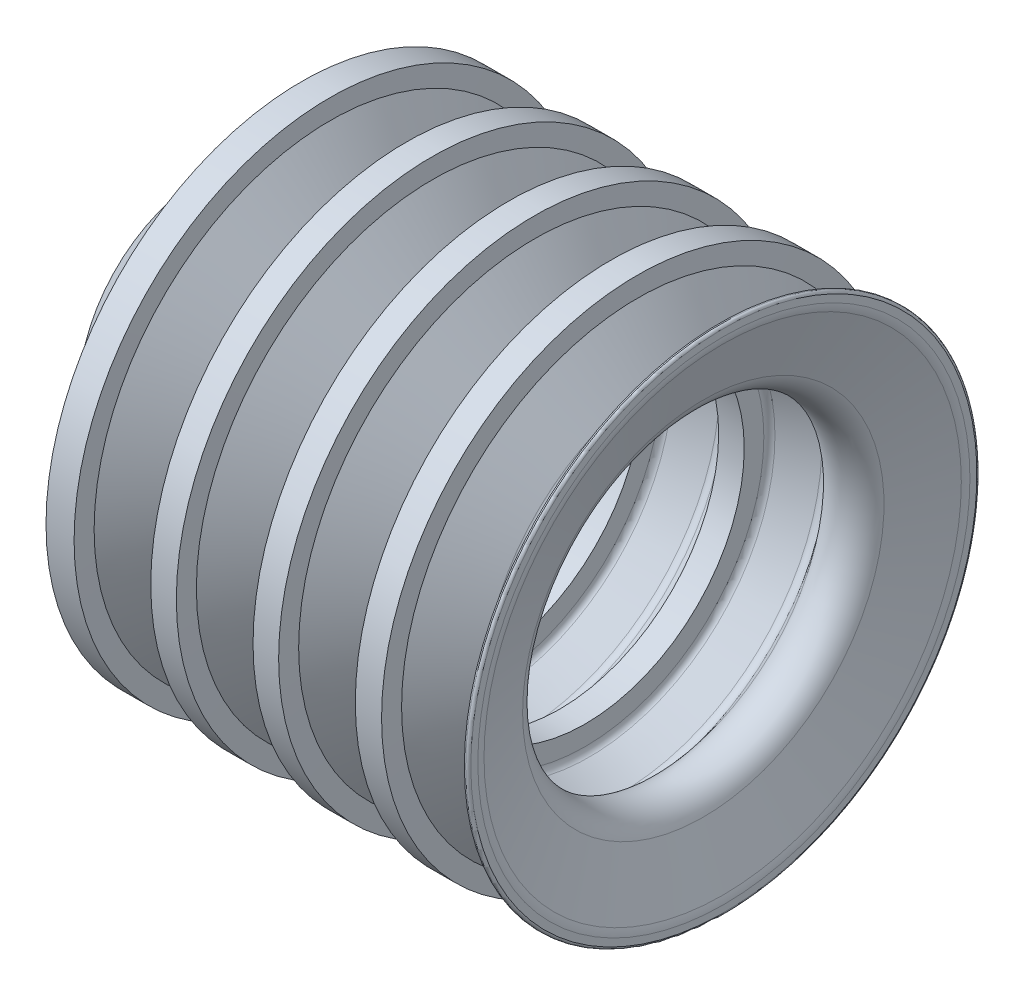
ISO-10303-21;
HEADER;
FILE_DESCRIPTION(('STEP AP214'),'2;1');
FILE_NAME('part.step','',(''),(''),'','','');
FILE_SCHEMA(('AUTOMOTIVE_DESIGN { 1 0 10303 214 1 1 1 1 }'));
ENDSEC;
DATA;
#1=APPLICATION_CONTEXT('core data for automotive mechanical design processes');
#2=APPLICATION_PROTOCOL_DEFINITION('international standard','automotive_design',2000,#1);
#3=PRODUCT_CONTEXT('',#1,'mechanical');
#4=PRODUCT('Part','Part','',(#3));
#5=PRODUCT_RELATED_PRODUCT_CATEGORY('part','',(#4));
#6=PRODUCT_DEFINITION_FORMATION('','',#4);
#7=PRODUCT_DEFINITION_CONTEXT('part definition',#1,'design');
#8=PRODUCT_DEFINITION('design','',#6,#7);
#9=PRODUCT_DEFINITION_SHAPE('','',#8);
#10=(LENGTH_UNIT() NAMED_UNIT(*) SI_UNIT(.MILLI.,.METRE.));
#11=(NAMED_UNIT(*) PLANE_ANGLE_UNIT() SI_UNIT($,.RADIAN.));
#12=(NAMED_UNIT(*) SI_UNIT($,.STERADIAN.) SOLID_ANGLE_UNIT());
#13=UNCERTAINTY_MEASURE_WITH_UNIT(LENGTH_MEASURE(1.E-05),#10,'distance_accuracy_value','');
#14=(GEOMETRIC_REPRESENTATION_CONTEXT(3) GLOBAL_UNCERTAINTY_ASSIGNED_CONTEXT((#13)) GLOBAL_UNIT_ASSIGNED_CONTEXT((#10,
#11,#12)) REPRESENTATION_CONTEXT('',''));
#15=CARTESIAN_POINT('',(0.,0.,0.));
#16=DIRECTION('',(0.,0.,1.));
#17=DIRECTION('',(1.,0.,0.));
#18=AXIS2_PLACEMENT_3D('',#15,#16,#17);
#19=CARTESIAN_POINT('',(51.11242,24.99868,0.));
#20=DIRECTION('',(-1.,0.,0.));
#21=DIRECTION('',(0.,0.,1.));
#22=AXIS2_PLACEMENT_3D('',#19,#20,#21);
#23=PLANE('',#22);
#24=CARTESIAN_POINT('',(51.11242,0.,0.));
#25=DIRECTION('',(-1.,0.,0.));
#26=DIRECTION('',(0.,0.,1.));
#27=AXIS2_PLACEMENT_3D('',#24,#25,#26);
#28=CIRCLE('',#27,24.0613960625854);
#29=CARTESIAN_POINT('',(51.11242,0.,24.0613960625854));
#30=VERTEX_POINT('',#29);
#31=EDGE_CURVE('E277',#30,#30,#28,.T.);
#32=ORIENTED_EDGE('',*,*,#31,.T.);
#33=EDGE_LOOP('',(#32));
#34=FACE_BOUND('',#33,.T.);
#35=CARTESIAN_POINT('',(51.11242,0.,0.));
#36=DIRECTION('',(-1.,0.,0.));
#37=DIRECTION('',(0.,0.,1.));
#38=AXIS2_PLACEMENT_3D('',#35,#36,#37);
#39=CIRCLE('',#38,24.74468);
#40=CARTESIAN_POINT('',(51.11242,0.,24.74468));
#41=VERTEX_POINT('',#40);
#42=EDGE_CURVE('E9',#41,#41,#39,.F.);
#43=ORIENTED_EDGE('',*,*,#42,.T.);
#44=EDGE_LOOP('',(#43));
#45=FACE_BOUND('',#44,.T.);
#46=ADVANCED_FACE('F14',(#34,#45),#23,.F.);
#47=CARTESIAN_POINT('',(0.,0.,0.));
#48=DIRECTION('',(-1.,0.,0.));
#49=DIRECTION('',(0.,0.,1.));
#50=AXIS2_PLACEMENT_3D('',#47,#48,#49);
#51=CYLINDRICAL_SURFACE('',#50,24.99868);
#52=CARTESIAN_POINT('',(50.85842,0.,0.));
#53=DIRECTION('',(-1.,0.,0.));
#54=DIRECTION('',(0.,0.,1.));
#55=AXIS2_PLACEMENT_3D('',#52,#53,#54);
#56=CIRCLE('',#55,24.99868);
#57=CARTESIAN_POINT('',(50.85842,0.,24.99868));
#58=VERTEX_POINT('',#57);
#59=EDGE_CURVE('E21',#58,#58,#56,.T.);
#60=ORIENTED_EDGE('',*,*,#59,.T.);
#61=EDGE_LOOP('',(#60));
#62=FACE_BOUND('',#61,.T.);
#63=CARTESIAN_POINT('',(50.73142,0.,0.));
#64=DIRECTION('',(-1.,0.,0.));
#65=DIRECTION('',(0.,0.,1.));
#66=AXIS2_PLACEMENT_3D('',#63,#64,#65);
#67=CIRCLE('',#66,24.99868);
#68=CARTESIAN_POINT('',(50.73142,0.,24.99868));
#69=VERTEX_POINT('',#68);
#70=EDGE_CURVE('E46',#69,#69,#67,.T.);
#71=ORIENTED_EDGE('',*,*,#70,.F.);
#72=EDGE_LOOP('',(#71));
#73=FACE_BOUND('',#72,.T.);
#74=ADVANCED_FACE('F319',(#62,#73),#51,.T.);
#75=CARTESIAN_POINT('',(50.73142,0.,0.));
#76=DIRECTION('',(1.,0.,0.));
#77=DIRECTION('',(0.,0.,-1.));
#78=AXIS2_PLACEMENT_3D('',#75,#76,#77);
#79=CONICAL_SURFACE('',#78,24.99868,1.02625360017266);
#80=CARTESIAN_POINT('',(46.75378,0.,0.));
#81=DIRECTION('',(-1.,0.,0.));
#82=DIRECTION('',(0.,0.,1.));
#83=AXIS2_PLACEMENT_3D('',#80,#81,#82);
#84=CIRCLE('',#83,18.4308157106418);
#85=CARTESIAN_POINT('',(46.75378,0.,18.4308157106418));
#86=VERTEX_POINT('',#85);
#87=EDGE_CURVE('E50',#86,#86,#84,.T.);
#88=ORIENTED_EDGE('',*,*,#87,.F.);
#89=EDGE_LOOP('',(#88));
#90=FACE_BOUND('',#89,.T.);
#91=ORIENTED_EDGE('',*,*,#70,.T.);
#92=EDGE_LOOP('',(#91));
#93=FACE_BOUND('',#92,.T.);
#94=ADVANCED_FACE('F325',(#90,#93),#79,.T.);
#95=CARTESIAN_POINT('',(46.3510684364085,0.,0.));
#96=DIRECTION('',(-1.,0.,0.));
#97=DIRECTION('',(0.,0.,1.));
#98=AXIS2_PLACEMENT_3D('',#95,#96,#97);
#99=TOROIDAL_SURFACE('',#98,18.7404726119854,0.507999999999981);
#100=CARTESIAN_POINT('',(45.902111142,0.,0.));
#101=DIRECTION('',(-1.,0.,0.));
#102=DIRECTION('',(0.,0.,1.));
#103=AXIS2_PLACEMENT_3D('',#100,#101,#102);
#104=CIRCLE('',#103,18.5027724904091);
#105=CARTESIAN_POINT('',(45.902111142,0.,18.5027724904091));
#106=VERTEX_POINT('',#105);
#107=EDGE_CURVE('E54',#106,#106,#104,.T.);
#108=ORIENTED_EDGE('',*,*,#107,.F.);
#109=EDGE_LOOP('',(#108));
#110=FACE_BOUND('',#109,.T.);
#111=ORIENTED_EDGE('',*,*,#87,.T.);
#112=EDGE_LOOP('',(#111));
#113=FACE_BOUND('',#112,.T.);
#114=ADVANCED_FACE('F480',(#110,#113),#99,.F.);
#115=CARTESIAN_POINT('',(45.902111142,0.,0.));
#116=DIRECTION('',(-1.,0.,0.));
#117=DIRECTION('',(0.,0.,1.));
#118=AXIS2_PLACEMENT_3D('',#115,#116,#117);
#119=CONICAL_SURFACE('',#118,18.5027724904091,0.963421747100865);
#120=CARTESIAN_POINT('',(42.7025205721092,0.,0.));
#121=DIRECTION('',(-1.,0.,0.));
#122=DIRECTION('',(0.,0.,1.));
#123=AXIS2_PLACEMENT_3D('',#120,#121,#122);
#124=CIRCLE('',#123,23.10638);
#125=CARTESIAN_POINT('',(42.7025205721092,0.,23.10638));
#126=VERTEX_POINT('',#125);
#127=EDGE_CURVE('E58',#126,#126,#124,.T.);
#128=ORIENTED_EDGE('',*,*,#127,.F.);
#129=EDGE_LOOP('',(#128));
#130=FACE_BOUND('',#129,.T.);
#131=ORIENTED_EDGE('',*,*,#107,.T.);
#132=EDGE_LOOP('',(#131));
#133=FACE_BOUND('',#132,.T.);
#134=ADVANCED_FACE('F474',(#130,#133),#119,.T.);
#135=CARTESIAN_POINT('',(42.7025205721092,0.,0.));
#136=DIRECTION('',(-1.,0.,0.));
#137=DIRECTION('',(0.,0.,1.));
#138=AXIS2_PLACEMENT_3D('',#135,#136,#137);
#139=CONICAL_SURFACE('',#138,23.10638,1.53588974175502);
#140=CARTESIAN_POINT('',(42.63644,0.,0.));
#141=DIRECTION('',(-1.,0.,0.));
#142=DIRECTION('',(0.,0.,1.));
#143=AXIS2_PLACEMENT_3D('',#140,#141,#142);
#144=CIRCLE('',#143,24.99868);
#145=CARTESIAN_POINT('',(42.63644,0.,24.99868));
#146=VERTEX_POINT('',#145);
#147=EDGE_CURVE('E62',#146,#146,#144,.T.);
#148=ORIENTED_EDGE('',*,*,#147,.F.);
#149=EDGE_LOOP('',(#148));
#150=FACE_BOUND('',#149,.T.);
#151=ORIENTED_EDGE('',*,*,#127,.T.);
#152=EDGE_LOOP('',(#151));
#153=FACE_BOUND('',#152,.T.);
#154=ADVANCED_FACE('F468',(#150,#153),#139,.T.);
#155=CARTESIAN_POINT('',(0.,0.,0.));
#156=DIRECTION('',(-1.,0.,0.));
#157=DIRECTION('',(0.,0.,1.));
#158=AXIS2_PLACEMENT_3D('',#155,#156,#157);
#159=CYLINDRICAL_SURFACE('',#158,24.99868);
#160=CARTESIAN_POINT('',(40.0685,0.,0.));
#161=DIRECTION('',(-1.,0.,0.));
#162=DIRECTION('',(0.,0.,1.));
#163=AXIS2_PLACEMENT_3D('',#160,#161,#162);
#164=CIRCLE('',#163,24.99868);
#165=CARTESIAN_POINT('',(40.0685,0.,24.99868));
#166=VERTEX_POINT('',#165);
#167=EDGE_CURVE('E66',#166,#166,#164,.T.);
#168=ORIENTED_EDGE('',*,*,#167,.F.);
#169=EDGE_LOOP('',(#168));
#170=FACE_BOUND('',#169,.T.);
#171=ORIENTED_EDGE('',*,*,#147,.T.);
#172=EDGE_LOOP('',(#171));
#173=FACE_BOUND('',#172,.T.);
#174=ADVANCED_FACE('F462',(#170,#173),#159,.T.);
#175=CARTESIAN_POINT('',(40.0685,0.,0.));
#176=DIRECTION('',(1.,0.,0.));
#177=DIRECTION('',(0.,0.,-1.));
#178=AXIS2_PLACEMENT_3D('',#175,#176,#177);
#179=CONICAL_SURFACE('',#178,24.99868,1.53588974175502);
#180=CARTESIAN_POINT('',(40.0024194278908,0.,0.));
#181=DIRECTION('',(-1.,0.,0.));
#182=DIRECTION('',(0.,0.,1.));
#183=AXIS2_PLACEMENT_3D('',#180,#181,#182);
#184=CIRCLE('',#183,23.10638);
#185=CARTESIAN_POINT('',(40.0024194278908,0.,23.10638));
#186=VERTEX_POINT('',#185);
#187=EDGE_CURVE('E70',#186,#186,#184,.T.);
#188=ORIENTED_EDGE('',*,*,#187,.F.);
#189=EDGE_LOOP('',(#188));
#190=FACE_BOUND('',#189,.T.);
#191=ORIENTED_EDGE('',*,*,#167,.T.);
#192=EDGE_LOOP('',(#191));
#193=FACE_BOUND('',#192,.T.);
#194=ADVANCED_FACE('F456',(#190,#193),#179,.T.);
#195=CARTESIAN_POINT('',(40.0024194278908,0.,0.));
#196=DIRECTION('',(1.,0.,0.));
#197=DIRECTION('',(0.,0.,-1.));
#198=AXIS2_PLACEMENT_3D('',#195,#196,#197);
#199=CONICAL_SURFACE('',#198,23.10638,0.963421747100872);
#200=CARTESIAN_POINT('',(36.73660379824,0.,0.));
#201=DIRECTION('',(-1.,0.,0.));
#202=DIRECTION('',(0.,0.,1.));
#203=AXIS2_PLACEMENT_3D('',#200,#201,#202);
#204=CIRCLE('',#203,18.4074871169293);
#205=CARTESIAN_POINT('',(36.73660379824,0.,18.4074871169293));
#206=VERTEX_POINT('',#205);
#207=EDGE_CURVE('E74',#206,#206,#204,.T.);
#208=ORIENTED_EDGE('',*,*,#207,.F.);
#209=EDGE_LOOP('',(#208));
#210=FACE_BOUND('',#209,.T.);
#211=ORIENTED_EDGE('',*,*,#187,.T.);
#212=EDGE_LOOP('',(#211));
#213=FACE_BOUND('',#212,.T.);
#214=ADVANCED_FACE('F450',(#210,#213),#199,.T.);
#215=CARTESIAN_POINT('',(36.31946,0.,0.));
#216=DIRECTION('',(-1.,0.,0.));
#217=DIRECTION('',(0.,0.,1.));
#218=AXIS2_PLACEMENT_3D('',#215,#216,#217);
#219=TOROIDAL_SURFACE('',#218,18.697409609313,0.508000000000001);
#220=CARTESIAN_POINT('',(35.9023162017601,0.,0.));
#221=DIRECTION('',(-1.,0.,0.));
#222=DIRECTION('',(0.,0.,1.));
#223=AXIS2_PLACEMENT_3D('',#220,#221,#222);
#224=CIRCLE('',#223,18.4074871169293);
#225=CARTESIAN_POINT('',(35.9023162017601,0.,18.4074871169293));
#226=VERTEX_POINT('',#225);
#227=EDGE_CURVE('E78',#226,#226,#224,.T.);
#228=ORIENTED_EDGE('',*,*,#227,.F.);
#229=EDGE_LOOP('',(#228));
#230=FACE_BOUND('',#229,.T.);
#231=ORIENTED_EDGE('',*,*,#207,.T.);
#232=EDGE_LOOP('',(#231));
#233=FACE_BOUND('',#232,.T.);
#234=ADVANCED_FACE('F444',(#230,#233),#219,.F.);
#235=CARTESIAN_POINT('',(35.9023162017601,0.,0.));
#236=DIRECTION('',(-1.,0.,0.));
#237=DIRECTION('',(0.,0.,1.));
#238=AXIS2_PLACEMENT_3D('',#235,#236,#237);
#239=CONICAL_SURFACE('',#238,18.4074871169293,0.963421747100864);
#240=CARTESIAN_POINT('',(32.6365005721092,0.,0.));
#241=DIRECTION('',(-1.,0.,0.));
#242=DIRECTION('',(0.,0.,1.));
#243=AXIS2_PLACEMENT_3D('',#240,#241,#242);
#244=CIRCLE('',#243,23.10638);
#245=CARTESIAN_POINT('',(32.6365005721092,0.,23.10638));
#246=VERTEX_POINT('',#245);
#247=EDGE_CURVE('E82',#246,#246,#244,.T.);
#248=ORIENTED_EDGE('',*,*,#247,.F.);
#249=EDGE_LOOP('',(#248));
#250=FACE_BOUND('',#249,.T.);
#251=ORIENTED_EDGE('',*,*,#227,.T.);
#252=EDGE_LOOP('',(#251));
#253=FACE_BOUND('',#252,.T.);
#254=ADVANCED_FACE('F438',(#250,#253),#239,.T.);
#255=CARTESIAN_POINT('',(32.6365005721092,0.,0.));
#256=DIRECTION('',(-1.,0.,0.));
#257=DIRECTION('',(0.,0.,1.));
#258=AXIS2_PLACEMENT_3D('',#255,#256,#257);
#259=CONICAL_SURFACE('',#258,23.10638,1.53588974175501);
#260=CARTESIAN_POINT('',(32.57042,0.,0.));
#261=DIRECTION('',(-1.,0.,0.));
#262=DIRECTION('',(0.,0.,1.));
#263=AXIS2_PLACEMENT_3D('',#260,#261,#262);
#264=CIRCLE('',#263,24.99868);
#265=CARTESIAN_POINT('',(32.57042,0.,24.99868));
#266=VERTEX_POINT('',#265);
#267=EDGE_CURVE('E86',#266,#266,#264,.T.);
#268=ORIENTED_EDGE('',*,*,#267,.F.);
#269=EDGE_LOOP('',(#268));
#270=FACE_BOUND('',#269,.T.);
#271=ORIENTED_EDGE('',*,*,#247,.T.);
#272=EDGE_LOOP('',(#271));
#273=FACE_BOUND('',#272,.T.);
#274=ADVANCED_FACE('F432',(#270,#273),#259,.T.);
#275=CARTESIAN_POINT('',(0.,0.,0.));
#276=DIRECTION('',(-1.,0.,0.));
#277=DIRECTION('',(0.,0.,1.));
#278=AXIS2_PLACEMENT_3D('',#275,#276,#277);
#279=CYLINDRICAL_SURFACE('',#278,24.99868);
#280=CARTESIAN_POINT('',(30.06852,0.,0.));
#281=DIRECTION('',(-1.,0.,0.));
#282=DIRECTION('',(0.,0.,1.));
#283=AXIS2_PLACEMENT_3D('',#280,#281,#282);
#284=CIRCLE('',#283,24.99868);
#285=CARTESIAN_POINT('',(30.06852,0.,24.99868));
#286=VERTEX_POINT('',#285);
#287=EDGE_CURVE('E90',#286,#286,#284,.T.);
#288=ORIENTED_EDGE('',*,*,#287,.F.);
#289=EDGE_LOOP('',(#288));
#290=FACE_BOUND('',#289,.T.);
#291=ORIENTED_EDGE('',*,*,#267,.T.);
#292=EDGE_LOOP('',(#291));
#293=FACE_BOUND('',#292,.T.);
#294=ADVANCED_FACE('F426',(#290,#293),#279,.T.);
#295=CARTESIAN_POINT('',(30.06852,0.,0.));
#296=DIRECTION('',(1.,0.,0.));
#297=DIRECTION('',(0.,0.,-1.));
#298=AXIS2_PLACEMENT_3D('',#295,#296,#297);
#299=CONICAL_SURFACE('',#298,24.99868,1.53588974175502);
#300=CARTESIAN_POINT('',(30.0024394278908,0.,0.));
#301=DIRECTION('',(-1.,0.,0.));
#302=DIRECTION('',(0.,0.,1.));
#303=AXIS2_PLACEMENT_3D('',#300,#301,#302);
#304=CIRCLE('',#303,23.10638);
#305=CARTESIAN_POINT('',(30.0024394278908,0.,23.10638));
#306=VERTEX_POINT('',#305);
#307=EDGE_CURVE('E94',#306,#306,#304,.T.);
#308=ORIENTED_EDGE('',*,*,#307,.F.);
#309=EDGE_LOOP('',(#308));
#310=FACE_BOUND('',#309,.T.);
#311=ORIENTED_EDGE('',*,*,#287,.T.);
#312=EDGE_LOOP('',(#311));
#313=FACE_BOUND('',#312,.T.);
#314=ADVANCED_FACE('F420',(#310,#313),#299,.T.);
#315=CARTESIAN_POINT('',(30.0024394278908,0.,0.));
#316=DIRECTION('',(1.,0.,0.));
#317=DIRECTION('',(0.,0.,-1.));
#318=AXIS2_PLACEMENT_3D('',#315,#316,#317);
#319=CONICAL_SURFACE('',#318,23.10638,0.963421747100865);
#320=CARTESIAN_POINT('',(26.73604,0.,0.));
#321=DIRECTION('',(-1.,0.,0.));
#322=DIRECTION('',(0.,0.,1.));
#323=AXIS2_PLACEMENT_3D('',#320,#321,#322);
#324=CIRCLE('',#323,18.4066471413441);
#325=CARTESIAN_POINT('',(26.73604,0.,18.4066471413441));
#326=VERTEX_POINT('',#325);
#327=EDGE_CURVE('E98',#326,#326,#324,.T.);
#328=ORIENTED_EDGE('',*,*,#327,.F.);
#329=EDGE_LOOP('',(#328));
#330=FACE_BOUND('',#329,.T.);
#331=ORIENTED_EDGE('',*,*,#307,.T.);
#332=EDGE_LOOP('',(#331));
#333=FACE_BOUND('',#332,.T.);
#334=ADVANCED_FACE('F414',(#330,#333),#319,.T.);
#335=CARTESIAN_POINT('',(26.3188962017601,0.,0.));
#336=DIRECTION('',(-1.,0.,0.));
#337=DIRECTION('',(0.,0.,1.));
#338=AXIS2_PLACEMENT_3D('',#335,#336,#337);
#339=TOROIDAL_SURFACE('',#338,18.6965696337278,0.508000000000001);
#340=CARTESIAN_POINT('',(25.90292,0.,0.));
#341=DIRECTION('',(-1.,0.,0.));
#342=DIRECTION('',(0.,0.,1.));
#343=AXIS2_PLACEMENT_3D('',#340,#341,#342);
#344=CIRCLE('',#343,18.4049743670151);
#345=CARTESIAN_POINT('',(25.90292,0.,18.4049743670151));
#346=VERTEX_POINT('',#345);
#347=EDGE_CURVE('E102',#346,#346,#344,.T.);
#348=ORIENTED_EDGE('',*,*,#347,.F.);
#349=EDGE_LOOP('',(#348));
#350=FACE_BOUND('',#349,.T.);
#351=ORIENTED_EDGE('',*,*,#327,.T.);
#352=EDGE_LOOP('',(#351));
#353=FACE_BOUND('',#352,.T.);
#354=ADVANCED_FACE('F408',(#350,#353),#339,.F.);
#355=CARTESIAN_POINT('',(25.90292,0.,0.));
#356=DIRECTION('',(-1.,0.,0.));
#357=DIRECTION('',(0.,0.,1.));
#358=AXIS2_PLACEMENT_3D('',#355,#356,#357);
#359=CONICAL_SURFACE('',#358,18.4049743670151,0.963421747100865);
#360=CARTESIAN_POINT('',(22.6353579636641,0.,0.));
#361=DIRECTION('',(-1.,0.,0.));
#362=DIRECTION('',(0.,0.,1.));
#363=AXIS2_PLACEMENT_3D('',#360,#361,#362);
#364=CIRCLE('',#363,23.10638);
#365=CARTESIAN_POINT('',(22.6353579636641,0.,23.10638));
#366=VERTEX_POINT('',#365);
#367=EDGE_CURVE('E106',#366,#366,#364,.T.);
#368=ORIENTED_EDGE('',*,*,#367,.F.);
#369=EDGE_LOOP('',(#368));
#370=FACE_BOUND('',#369,.T.);
#371=ORIENTED_EDGE('',*,*,#347,.T.);
#372=EDGE_LOOP('',(#371));
#373=FACE_BOUND('',#372,.T.);
#374=ADVANCED_FACE('F402',(#370,#373),#359,.T.);
#375=CARTESIAN_POINT('',(22.6353579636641,0.,0.));
#376=DIRECTION('',(-1.,0.,0.));
#377=DIRECTION('',(0.,0.,1.));
#378=AXIS2_PLACEMENT_3D('',#375,#376,#377);
#379=CONICAL_SURFACE('',#378,23.10638,1.53588974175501);
#380=CARTESIAN_POINT('',(22.5692773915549,0.,0.));
#381=DIRECTION('',(-1.,0.,0.));
#382=DIRECTION('',(0.,0.,1.));
#383=AXIS2_PLACEMENT_3D('',#380,#381,#382);
#384=CIRCLE('',#383,24.99868);
#385=CARTESIAN_POINT('',(22.5692773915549,0.,24.99868));
#386=VERTEX_POINT('',#385);
#387=EDGE_CURVE('E110',#386,#386,#384,.T.);
#388=ORIENTED_EDGE('',*,*,#387,.F.);
#389=EDGE_LOOP('',(#388));
#390=FACE_BOUND('',#389,.T.);
#391=ORIENTED_EDGE('',*,*,#367,.T.);
#392=EDGE_LOOP('',(#391));
#393=FACE_BOUND('',#392,.T.);
#394=ADVANCED_FACE('F396',(#390,#393),#379,.T.);
#395=CARTESIAN_POINT('',(0.,0.,0.));
#396=DIRECTION('',(-1.,0.,0.));
#397=DIRECTION('',(0.,0.,1.));
#398=AXIS2_PLACEMENT_3D('',#395,#396,#397);
#399=CYLINDRICAL_SURFACE('',#398,24.99868);
#400=CARTESIAN_POINT('',(20.06854,0.,0.));
#401=DIRECTION('',(-1.,0.,0.));
#402=DIRECTION('',(0.,0.,1.));
#403=AXIS2_PLACEMENT_3D('',#400,#401,#402);
#404=CIRCLE('',#403,24.99868);
#405=CARTESIAN_POINT('',(20.06854,0.,24.99868));
#406=VERTEX_POINT('',#405);
#407=EDGE_CURVE('E114',#406,#406,#404,.T.);
#408=ORIENTED_EDGE('',*,*,#407,.F.);
#409=EDGE_LOOP('',(#408));
#410=FACE_BOUND('',#409,.T.);
#411=ORIENTED_EDGE('',*,*,#387,.T.);
#412=EDGE_LOOP('',(#411));
#413=FACE_BOUND('',#412,.T.);
#414=ADVANCED_FACE('F390',(#410,#413),#399,.T.);
#415=CARTESIAN_POINT('',(20.06854,0.,0.));
#416=DIRECTION('',(1.,0.,0.));
#417=DIRECTION('',(0.,0.,-1.));
#418=AXIS2_PLACEMENT_3D('',#415,#416,#417);
#419=CONICAL_SURFACE('',#418,24.99868,1.53588974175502);
#420=CARTESIAN_POINT('',(20.0024594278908,0.,0.));
#421=DIRECTION('',(-1.,0.,0.));
#422=DIRECTION('',(0.,0.,1.));
#423=AXIS2_PLACEMENT_3D('',#420,#421,#422);
#424=CIRCLE('',#423,23.10638);
#425=CARTESIAN_POINT('',(20.0024594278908,0.,23.10638));
#426=VERTEX_POINT('',#425);
#427=EDGE_CURVE('E118',#426,#426,#424,.T.);
#428=ORIENTED_EDGE('',*,*,#427,.F.);
#429=EDGE_LOOP('',(#428));
#430=FACE_BOUND('',#429,.T.);
#431=ORIENTED_EDGE('',*,*,#407,.T.);
#432=EDGE_LOOP('',(#431));
#433=FACE_BOUND('',#432,.T.);
#434=ADVANCED_FACE('F384',(#430,#433),#419,.T.);
#435=CARTESIAN_POINT('',(20.0024594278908,0.,0.));
#436=DIRECTION('',(1.,0.,0.));
#437=DIRECTION('',(0.,0.,-1.));
#438=AXIS2_PLACEMENT_3D('',#435,#436,#437);
#439=CONICAL_SURFACE('',#438,23.10638,0.963421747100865);
#440=CARTESIAN_POINT('',(16.73606,0.,0.));
#441=DIRECTION('',(-1.,0.,0.));
#442=DIRECTION('',(0.,0.,1.));
#443=AXIS2_PLACEMENT_3D('',#440,#441,#442);
#444=CIRCLE('',#443,18.4066471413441);
#445=CARTESIAN_POINT('',(16.73606,0.,18.4066471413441));
#446=VERTEX_POINT('',#445);
#447=EDGE_CURVE('E122',#446,#446,#444,.T.);
#448=ORIENTED_EDGE('',*,*,#447,.F.);
#449=EDGE_LOOP('',(#448));
#450=FACE_BOUND('',#449,.T.);
#451=ORIENTED_EDGE('',*,*,#427,.T.);
#452=EDGE_LOOP('',(#451));
#453=FACE_BOUND('',#452,.T.);
#454=ADVANCED_FACE('F378',(#450,#453),#439,.T.);
#455=CARTESIAN_POINT('',(16.3195,0.,0.));
#456=DIRECTION('',(-1.,0.,0.));
#457=DIRECTION('',(0.,0.,1.));
#458=AXIS2_PLACEMENT_3D('',#455,#456,#457);
#459=TOROIDAL_SURFACE('',#458,18.6974078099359,0.507999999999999);
#460=CARTESIAN_POINT('',(15.90294,0.,0.));
#461=DIRECTION('',(-1.,0.,0.));
#462=DIRECTION('',(0.,0.,1.));
#463=AXIS2_PLACEMENT_3D('',#460,#461,#462);
#464=CIRCLE('',#463,18.406647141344);
#465=CARTESIAN_POINT('',(15.90294,0.,18.406647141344));
#466=VERTEX_POINT('',#465);
#467=EDGE_CURVE('E126',#466,#466,#464,.T.);
#468=ORIENTED_EDGE('',*,*,#467,.F.);
#469=EDGE_LOOP('',(#468));
#470=FACE_BOUND('',#469,.T.);
#471=ORIENTED_EDGE('',*,*,#447,.T.);
#472=EDGE_LOOP('',(#471));
#473=FACE_BOUND('',#472,.T.);
#474=ADVANCED_FACE('F372',(#470,#473),#459,.F.);
#475=CARTESIAN_POINT('',(15.90294,0.,0.));
#476=DIRECTION('',(-1.,0.,0.));
#477=DIRECTION('',(0.,0.,1.));
#478=AXIS2_PLACEMENT_3D('',#475,#476,#477);
#479=CONICAL_SURFACE('',#478,18.406647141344,0.963421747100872);
#480=CARTESIAN_POINT('',(12.6365405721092,0.,0.));
#481=DIRECTION('',(-1.,0.,0.));
#482=DIRECTION('',(0.,0.,1.));
#483=AXIS2_PLACEMENT_3D('',#480,#481,#482);
#484=CIRCLE('',#483,23.10638);
#485=CARTESIAN_POINT('',(12.6365405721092,0.,23.10638));
#486=VERTEX_POINT('',#485);
#487=EDGE_CURVE('E130',#486,#486,#484,.T.);
#488=ORIENTED_EDGE('',*,*,#487,.F.);
#489=EDGE_LOOP('',(#488));
#490=FACE_BOUND('',#489,.T.);
#491=ORIENTED_EDGE('',*,*,#467,.T.);
#492=EDGE_LOOP('',(#491));
#493=FACE_BOUND('',#492,.T.);
#494=ADVANCED_FACE('F366',(#490,#493),#479,.T.);
#495=CARTESIAN_POINT('',(12.6365405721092,0.,0.));
#496=DIRECTION('',(-1.,0.,0.));
#497=DIRECTION('',(0.,0.,1.));
#498=AXIS2_PLACEMENT_3D('',#495,#496,#497);
#499=CONICAL_SURFACE('',#498,23.10638,1.53588974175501);
#500=CARTESIAN_POINT('',(12.57046,0.,0.));
#501=DIRECTION('',(-1.,0.,0.));
#502=DIRECTION('',(0.,0.,1.));
#503=AXIS2_PLACEMENT_3D('',#500,#501,#502);
#504=CIRCLE('',#503,24.99868);
#505=CARTESIAN_POINT('',(12.57046,0.,24.99868));
#506=VERTEX_POINT('',#505);
#507=EDGE_CURVE('E133',#506,#506,#504,.T.);
#508=ORIENTED_EDGE('',*,*,#507,.F.);
#509=EDGE_LOOP('',(#508));
#510=FACE_BOUND('',#509,.T.);
#511=ORIENTED_EDGE('',*,*,#487,.T.);
#512=EDGE_LOOP('',(#511));
#513=FACE_BOUND('',#512,.T.);
#514=ADVANCED_FACE('F360',(#510,#513),#499,.T.);
#515=CARTESIAN_POINT('',(0.,0.,0.));
#516=DIRECTION('',(-1.,0.,0.));
#517=DIRECTION('',(0.,0.,1.));
#518=AXIS2_PLACEMENT_3D('',#515,#516,#517);
#519=CYLINDRICAL_SURFACE('',#518,24.99868);
#520=CARTESIAN_POINT('',(9.82445855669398,0.,0.));
#521=DIRECTION('',(-1.,0.,0.));
#522=DIRECTION('',(0.,0.,1.));
#523=AXIS2_PLACEMENT_3D('',#520,#521,#522);
#524=CIRCLE('',#523,24.99868);
#525=CARTESIAN_POINT('',(9.82445855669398,0.,24.99868));
#526=VERTEX_POINT('',#525);
#527=EDGE_CURVE('E137',#526,#526,#524,.T.);
#528=ORIENTED_EDGE('',*,*,#527,.F.);
#529=EDGE_LOOP('',(#528));
#530=FACE_BOUND('',#529,.T.);
#531=ORIENTED_EDGE('',*,*,#507,.T.);
#532=EDGE_LOOP('',(#531));
#533=FACE_BOUND('',#532,.T.);
#534=ADVANCED_FACE('F315',(#530,#533),#519,.T.);
#535=CARTESIAN_POINT('',(9.82445855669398,0.,0.));
#536=DIRECTION('',(1.,0.,0.));
#537=DIRECTION('',(0.,0.,-1.));
#538=AXIS2_PLACEMENT_3D('',#535,#536,#537);
#539=CONICAL_SURFACE('',#538,24.99868,1.53588974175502);
#540=CARTESIAN_POINT('',(9.79485985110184,0.,0.));
#541=DIRECTION('',(1.,0.,0.));
#542=DIRECTION('',(0.,0.,-1.));
#543=AXIS2_PLACEMENT_3D('',#540,#541,#542);
#544=CIRCLE('',#543,24.1510839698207);
#545=CARTESIAN_POINT('',(9.79485985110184,0.,-24.1510839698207));
#546=VERTEX_POINT('',#545);
#547=EDGE_CURVE('E31',#546,#546,#544,.T.);
#548=ORIENTED_EDGE('',*,*,#547,.T.);
#549=EDGE_LOOP('',(#548));
#550=FACE_BOUND('',#549,.T.);
#551=ORIENTED_EDGE('',*,*,#527,.T.);
#552=EDGE_LOOP('',(#551));
#553=FACE_BOUND('',#552,.T.);
#554=ADVANCED_FACE('F307',(#550,#553),#539,.T.);
#555=CARTESIAN_POINT('',(9.77664992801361,0.,0.));
#556=DIRECTION('',(1.,0.,0.));
#557=DIRECTION('',(0.,0.,-1.));
#558=AXIS2_PLACEMENT_3D('',#555,#556,#557);
#559=CONICAL_SURFACE('',#558,23.62962,0.876155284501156);
#560=CARTESIAN_POINT('',(9.4426523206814,0.,0.));
#561=DIRECTION('',(1.,0.,0.));
#562=DIRECTION('',(0.,0.,-1.));
#563=AXIS2_PLACEMENT_3D('',#560,#561,#562);
#564=CIRCLE('',#563,23.2287436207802);
#565=CARTESIAN_POINT('',(9.4426523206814,0.,-23.2287436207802));
#566=VERTEX_POINT('',#565);
#567=EDGE_CURVE('E40',#566,#566,#564,.F.);
#568=ORIENTED_EDGE('',*,*,#567,.T.);
#569=EDGE_LOOP('',(#568));
#570=FACE_BOUND('',#569,.T.);
#571=CARTESIAN_POINT('',(0.353135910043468,0.,0.));
#572=DIRECTION('',(-1.,0.,0.));
#573=DIRECTION('',(0.,0.,1.));
#574=AXIS2_PLACEMENT_3D('',#571,#572,#573);
#575=CIRCLE('',#574,12.3191671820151);
#576=CARTESIAN_POINT('',(0.353135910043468,0.,12.3191671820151));
#577=VERTEX_POINT('',#576);
#578=EDGE_CURVE('E141',#577,#577,#575,.T.);
#579=ORIENTED_EDGE('',*,*,#578,.F.);
#580=EDGE_LOOP('',(#579));
#581=FACE_BOUND('',#580,.T.);
#582=ADVANCED_FACE('F302',(#570,#581),#559,.T.);
#583=CARTESIAN_POINT('',(1.524,0.,0.));
#584=DIRECTION('',(-1.,0.,0.));
#585=DIRECTION('',(0.,0.,1.));
#586=AXIS2_PLACEMENT_3D('',#583,#584,#585);
#587=TOROIDAL_SURFACE('',#586,11.34364,1.524);
#588=CARTESIAN_POINT('',(0.,0.,0.));
#589=DIRECTION('',(-1.,0.,0.));
#590=DIRECTION('',(0.,0.,1.));
#591=AXIS2_PLACEMENT_3D('',#588,#589,#590);
#592=CIRCLE('',#591,11.34364);
#593=CARTESIAN_POINT('',(0.,0.,11.34364));
#594=VERTEX_POINT('',#593);
#595=EDGE_CURVE('E145',#594,#594,#592,.T.);
#596=ORIENTED_EDGE('',*,*,#595,.F.);
#597=EDGE_LOOP('',(#596));
#598=FACE_BOUND('',#597,.T.);
#599=ORIENTED_EDGE('',*,*,#578,.T.);
#600=EDGE_LOOP('',(#599));
#601=FACE_BOUND('',#600,.T.);
#602=ADVANCED_FACE('F296',(#598,#601),#587,.T.);
#603=CARTESIAN_POINT('',(0.,0.,0.));
#604=DIRECTION('',(1.,0.,0.));
#605=DIRECTION('',(0.,0.,-1.));
#606=AXIS2_PLACEMENT_3D('',#603,#604,#605);
#607=PLANE('',#606);
#608=CARTESIAN_POINT('',(0.,0.,0.));
#609=DIRECTION('',(-1.,0.,0.));
#610=DIRECTION('',(0.,0.,1.));
#611=AXIS2_PLACEMENT_3D('',#608,#609,#610);
#612=CIRCLE('',#611,6.096);
#613=CARTESIAN_POINT('',(0.,0.,6.096));
#614=VERTEX_POINT('',#613);
#615=EDGE_CURVE('E281',#614,#614,#612,.T.);
#616=ORIENTED_EDGE('',*,*,#615,.F.);
#617=EDGE_LOOP('',(#616));
#618=FACE_BOUND('',#617,.T.);
#619=ORIENTED_EDGE('',*,*,#595,.T.);
#620=EDGE_LOOP('',(#619));
#621=FACE_BOUND('',#620,.T.);
#622=ADVANCED_FACE('F292',(#618,#621),#607,.F.);
#623=CARTESIAN_POINT('',(8.27178823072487,0.,0.));
#624=DIRECTION('',(-1.,0.,0.));
#625=DIRECTION('',(0.,0.,1.));
#626=AXIS2_PLACEMENT_3D('',#623,#624,#625);
#627=TOROIDAL_SURFACE('',#626,24.2042708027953,1.524);
#628=ORIENTED_EDGE('',*,*,#547,.F.);
#629=EDGE_LOOP('',(#628));
#630=FACE_BOUND('',#629,.T.);
#631=ORIENTED_EDGE('',*,*,#567,.F.);
#632=EDGE_LOOP('',(#631));
#633=FACE_BOUND('',#632,.T.);
#634=ADVANCED_FACE('F295',(#630,#633),#627,.F.);
#635=CARTESIAN_POINT('',(50.85842,0.,0.));
#636=DIRECTION('',(-1.,0.,0.));
#637=DIRECTION('',(0.,0.,1.));
#638=AXIS2_PLACEMENT_3D('',#635,#636,#637);
#639=TOROIDAL_SURFACE('',#638,24.74468,0.254);
#640=ORIENTED_EDGE('',*,*,#42,.F.);
#641=EDGE_LOOP('',(#640));
#642=FACE_BOUND('',#641,.T.);
#643=ORIENTED_EDGE('',*,*,#59,.F.);
#644=EDGE_LOOP('',(#643));
#645=FACE_BOUND('',#644,.T.);
#646=ADVANCED_FACE('F331',(#642,#645),#639,.T.);
#647=CARTESIAN_POINT('',(48.82642,0.,0.));
#648=DIRECTION('',(-1.,0.,0.));
#649=DIRECTION('',(0.,0.,1.));
#650=AXIS2_PLACEMENT_3D('',#647,#648,#649);
#651=TOROIDAL_SURFACE('',#650,24.0613960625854,2.286);
#652=CARTESIAN_POINT('',(50.9945795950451,0.,0.));
#653=DIRECTION('',(1.,0.,0.));
#654=DIRECTION('',(0.,0.,-1.));
#655=AXIS2_PLACEMENT_3D('',#652,#653,#654);
#656=CIRCLE('',#655,23.336910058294);
#657=CARTESIAN_POINT('',(50.9945795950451,0.,-23.336910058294));
#658=VERTEX_POINT('',#657);
#659=EDGE_CURVE('E149',#658,#658,#656,.T.);
#660=ORIENTED_EDGE('',*,*,#659,.F.);
#661=EDGE_LOOP('',(#660));
#662=FACE_BOUND('',#661,.T.);
#663=ORIENTED_EDGE('',*,*,#31,.F.);
#664=EDGE_LOOP('',(#663));
#665=FACE_BOUND('',#664,.T.);
#666=ADVANCED_FACE('F328',(#662,#665),#651,.T.);
#667=CARTESIAN_POINT('',(51.11242,0.,0.));
#668=DIRECTION('',(1.,0.,0.));
#669=DIRECTION('',(0.,0.,-1.));
#670=AXIS2_PLACEMENT_3D('',#667,#668,#669);
#671=CONICAL_SURFACE('',#670,23.6895694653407,1.24831282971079);
#672=ORIENTED_EDGE('',*,*,#659,.T.);
#673=EDGE_LOOP('',(#672));
#674=FACE_BOUND('',#673,.T.);
#675=CARTESIAN_POINT('',(49.1009939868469,0.,0.));
#676=DIRECTION('',(-1.,0.,0.));
#677=DIRECTION('',(0.,0.,1.));
#678=AXIS2_PLACEMENT_3D('',#675,#676,#677);
#679=CIRCLE('',#678,17.6700016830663);
#680=CARTESIAN_POINT('',(49.1009939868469,0.,17.6700016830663));
#681=VERTEX_POINT('',#680);
#682=EDGE_CURVE('E153',#681,#681,#679,.T.);
#683=ORIENTED_EDGE('',*,*,#682,.T.);
#684=EDGE_LOOP('',(#683));
#685=FACE_BOUND('',#684,.T.);
#686=ADVANCED_FACE('F330',(#674,#685),#671,.F.);
#687=CARTESIAN_POINT('',(46.3572814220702,0.,0.));
#688=DIRECTION('',(-1.,0.,0.));
#689=DIRECTION('',(0.,0.,1.));
#690=AXIS2_PLACEMENT_3D('',#687,#688,#689);
#691=TOROIDAL_SURFACE('',#690,18.5868075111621,2.89283452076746);
#692=CARTESIAN_POINT('',(44.0917411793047,0.,0.));
#693=DIRECTION('',(-1.,0.,0.));
#694=DIRECTION('',(0.,0.,1.));
#695=AXIS2_PLACEMENT_3D('',#692,#693,#694);
#696=CIRCLE('',#695,16.7879692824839);
#697=CARTESIAN_POINT('',(44.0917411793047,0.,16.7879692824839));
#698=VERTEX_POINT('',#697);
#699=EDGE_CURVE('E157',#698,#698,#696,.T.);
#700=ORIENTED_EDGE('',*,*,#699,.T.);
#701=EDGE_LOOP('',(#700));
#702=FACE_BOUND('',#701,.T.);
#703=ORIENTED_EDGE('',*,*,#682,.F.);
#704=EDGE_LOOP('',(#703));
#705=FACE_BOUND('',#704,.T.);
#706=ADVANCED_FACE('F339',(#702,#705),#691,.T.);
#707=CARTESIAN_POINT('',(44.0917411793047,0.,0.));
#708=DIRECTION('',(-1.,0.,0.));
#709=DIRECTION('',(0.,0.,1.));
#710=AXIS2_PLACEMENT_3D('',#707,#708,#709);
#711=CONICAL_SURFACE('',#710,16.7879692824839,0.899724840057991);
#712=CARTESIAN_POINT('',(41.9173060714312,0.,0.));
#713=DIRECTION('',(-1.,0.,0.));
#714=DIRECTION('',(0.,0.,1.));
#715=AXIS2_PLACEMENT_3D('',#712,#713,#714);
#716=CIRCLE('',#715,19.5265536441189);
#717=CARTESIAN_POINT('',(41.9173060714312,0.,19.5265536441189));
#718=VERTEX_POINT('',#717);
#719=EDGE_CURVE('E161',#718,#718,#716,.T.);
#720=ORIENTED_EDGE('',*,*,#719,.T.);
#721=EDGE_LOOP('',(#720));
#722=FACE_BOUND('',#721,.T.);
#723=ORIENTED_EDGE('',*,*,#699,.F.);
#724=EDGE_LOOP('',(#723));
#725=FACE_BOUND('',#724,.T.);
#726=ADVANCED_FACE('F930',(#722,#725),#711,.F.);
#727=CARTESIAN_POINT('',(41.3205413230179,0.,0.));
#728=DIRECTION('',(-1.,0.,0.));
#729=DIRECTION('',(0.,0.,1.));
#730=AXIS2_PLACEMENT_3D('',#727,#728,#729);
#731=TOROIDAL_SURFACE('',#730,19.0527226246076,0.762000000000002);
#732=CARTESIAN_POINT('',(40.9689451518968,0.,0.));
#733=DIRECTION('',(-1.,0.,0.));
#734=DIRECTION('',(0.,0.,1.));
#735=AXIS2_PLACEMENT_3D('',#732,#733,#734);
#736=CIRCLE('',#735,19.728758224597);
#737=CARTESIAN_POINT('',(40.9689451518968,0.,19.728758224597));
#738=VERTEX_POINT('',#737);
#739=EDGE_CURVE('E165',#738,#738,#736,.T.);
#740=ORIENTED_EDGE('',*,*,#739,.T.);
#741=EDGE_LOOP('',(#740));
#742=FACE_BOUND('',#741,.T.);
#743=ORIENTED_EDGE('',*,*,#719,.F.);
#744=EDGE_LOOP('',(#743));
#745=FACE_BOUND('',#744,.T.);
#746=ADVANCED_FACE('F919',(#742,#745),#731,.F.);
#747=CARTESIAN_POINT('',(40.9689451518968,0.,0.));
#748=DIRECTION('',(1.,0.,0.));
#749=DIRECTION('',(0.,0.,-1.));
#750=AXIS2_PLACEMENT_3D('',#747,#748,#749);
#751=CONICAL_SURFACE('',#750,19.728758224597,0.479586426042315);
#752=CARTESIAN_POINT('',(37.9495857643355,0.,0.));
#753=DIRECTION('',(-1.,0.,0.));
#754=DIRECTION('',(0.,0.,1.));
#755=AXIS2_PLACEMENT_3D('',#752,#753,#754);
#756=CIRCLE('',#755,18.1584338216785);
#757=CARTESIAN_POINT('',(37.9495857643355,0.,18.1584338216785));
#758=VERTEX_POINT('',#757);
#759=EDGE_CURVE('E169',#758,#758,#756,.T.);
#760=ORIENTED_EDGE('',*,*,#759,.T.);
#761=EDGE_LOOP('',(#760));
#762=FACE_BOUND('',#761,.T.);
#763=ORIENTED_EDGE('',*,*,#739,.F.);
#764=EDGE_LOOP('',(#763));
#765=FACE_BOUND('',#764,.T.);
#766=ADVANCED_FACE('F906',(#762,#765),#751,.F.);
#767=CARTESIAN_POINT('',(38.3011819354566,0.,0.));
#768=DIRECTION('',(-1.,0.,0.));
#769=DIRECTION('',(0.,0.,1.));
#770=AXIS2_PLACEMENT_3D('',#767,#768,#769);
#771=TOROIDAL_SURFACE('',#770,17.4823982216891,0.761999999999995);
#772=CARTESIAN_POINT('',(37.5391819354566,0.,0.));
#773=DIRECTION('',(-1.,0.,0.));
#774=DIRECTION('',(0.,0.,1.));
#775=AXIS2_PLACEMENT_3D('',#772,#773,#774);
#776=CIRCLE('',#775,17.4823982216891);
#777=CARTESIAN_POINT('',(37.5391819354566,0.,17.4823982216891));
#778=VERTEX_POINT('',#777);
#779=EDGE_CURVE('E173',#778,#778,#776,.T.);
#780=ORIENTED_EDGE('',*,*,#779,.T.);
#781=EDGE_LOOP('',(#780));
#782=FACE_BOUND('',#781,.T.);
#783=ORIENTED_EDGE('',*,*,#759,.F.);
#784=EDGE_LOOP('',(#783));
#785=FACE_BOUND('',#784,.T.);
#786=ADVANCED_FACE('F732',(#782,#785),#771,.F.);
#787=CARTESIAN_POINT('',(37.5391819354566,15.5646047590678,0.));
#788=DIRECTION('',(1.,0.,0.));
#789=DIRECTION('',(0.,0.,-1.));
#790=AXIS2_PLACEMENT_3D('',#787,#788,#789);
#791=PLANE('',#790);
#792=CARTESIAN_POINT('',(37.5391819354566,0.,0.));
#793=DIRECTION('',(-1.,0.,0.));
#794=DIRECTION('',(0.,0.,1.));
#795=AXIS2_PLACEMENT_3D('',#792,#793,#794);
#796=CIRCLE('',#795,15.5646047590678);
#797=CARTESIAN_POINT('',(37.5391819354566,0.,15.5646047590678));
#798=VERTEX_POINT('',#797);
#799=EDGE_CURVE('E177',#798,#798,#796,.T.);
#800=ORIENTED_EDGE('',*,*,#799,.T.);
#801=EDGE_LOOP('',(#800));
#802=FACE_BOUND('',#801,.T.);
#803=ORIENTED_EDGE('',*,*,#779,.F.);
#804=EDGE_LOOP('',(#803));
#805=FACE_BOUND('',#804,.T.);
#806=ADVANCED_FACE('F726',(#802,#805),#791,.T.);
#807=CARTESIAN_POINT('',(0.,0.,0.));
#808=DIRECTION('',(-1.,0.,0.));
#809=DIRECTION('',(0.,0.,1.));
#810=AXIS2_PLACEMENT_3D('',#807,#808,#809);
#811=CYLINDRICAL_SURFACE('',#810,15.5646047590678);
#812=CARTESIAN_POINT('',(35.0398219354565,0.,0.));
#813=DIRECTION('',(-1.,0.,0.));
#814=DIRECTION('',(0.,0.,1.));
#815=AXIS2_PLACEMENT_3D('',#812,#813,#814);
#816=CIRCLE('',#815,15.5646047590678);
#817=CARTESIAN_POINT('',(35.0398219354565,0.,15.5646047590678));
#818=VERTEX_POINT('',#817);
#819=EDGE_CURVE('E181',#818,#818,#816,.T.);
#820=ORIENTED_EDGE('',*,*,#819,.T.);
#821=EDGE_LOOP('',(#820));
#822=FACE_BOUND('',#821,.T.);
#823=ORIENTED_EDGE('',*,*,#799,.F.);
#824=EDGE_LOOP('',(#823));
#825=FACE_BOUND('',#824,.T.);
#826=ADVANCED_FACE('F731',(#822,#825),#811,.F.);
#827=CARTESIAN_POINT('',(35.0398219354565,15.5646047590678,0.));
#828=DIRECTION('',(-1.,0.,0.));
#829=DIRECTION('',(0.,0.,1.));
#830=AXIS2_PLACEMENT_3D('',#827,#828,#829);
#831=PLANE('',#830);
#832=CARTESIAN_POINT('',(35.0398219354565,0.,0.));
#833=DIRECTION('',(-1.,0.,0.));
#834=DIRECTION('',(0.,0.,1.));
#835=AXIS2_PLACEMENT_3D('',#832,#833,#834);
#836=CIRCLE('',#835,17.4823982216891);
#837=CARTESIAN_POINT('',(35.0398219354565,0.,17.4823982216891));
#838=VERTEX_POINT('',#837);
#839=EDGE_CURVE('E185',#838,#838,#836,.T.);
#840=ORIENTED_EDGE('',*,*,#839,.T.);
#841=EDGE_LOOP('',(#840));
#842=FACE_BOUND('',#841,.T.);
#843=ORIENTED_EDGE('',*,*,#819,.F.);
#844=EDGE_LOOP('',(#843));
#845=FACE_BOUND('',#844,.T.);
#846=ADVANCED_FACE('F1120',(#842,#845),#831,.T.);
#847=CARTESIAN_POINT('',(34.2778219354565,0.,0.));
#848=DIRECTION('',(-1.,0.,0.));
#849=DIRECTION('',(0.,0.,1.));
#850=AXIS2_PLACEMENT_3D('',#847,#848,#849);
#851=TOROIDAL_SURFACE('',#850,17.4823982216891,0.762000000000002);
#852=CARTESIAN_POINT('',(34.6351903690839,0.,0.));
#853=DIRECTION('',(-1.,0.,0.));
#854=DIRECTION('',(0.,0.,1.));
#855=AXIS2_PLACEMENT_3D('',#852,#853,#854);
#856=CIRCLE('',#855,18.15540030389);
#857=CARTESIAN_POINT('',(34.6351903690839,0.,18.15540030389));
#858=VERTEX_POINT('',#857);
#859=EDGE_CURVE('E189',#858,#858,#856,.T.);
#860=ORIENTED_EDGE('',*,*,#859,.T.);
#861=EDGE_LOOP('',(#860));
#862=FACE_BOUND('',#861,.T.);
#863=ORIENTED_EDGE('',*,*,#839,.F.);
#864=EDGE_LOOP('',(#863));
#865=FACE_BOUND('',#864,.T.);
#866=ADVANCED_FACE('F1114',(#862,#865),#851,.F.);
#867=CARTESIAN_POINT('',(34.6351903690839,0.,0.));
#868=DIRECTION('',(-1.,0.,0.));
#869=DIRECTION('',(0.,0.,1.));
#870=AXIS2_PLACEMENT_3D('',#867,#868,#869);
#871=CONICAL_SURFACE('',#870,18.15540030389,0.488143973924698);
#872=CARTESIAN_POINT('',(31.6779297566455,0.,0.));
#873=DIRECTION('',(-1.,0.,0.));
#874=DIRECTION('',(0.,0.,1.));
#875=AXIS2_PLACEMENT_3D('',#872,#873,#874);
#876=CIRCLE('',#875,19.7257247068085);
#877=CARTESIAN_POINT('',(31.6779297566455,0.,19.7257247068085));
#878=VERTEX_POINT('',#877);
#879=EDGE_CURVE('E193',#878,#878,#876,.T.);
#880=ORIENTED_EDGE('',*,*,#879,.T.);
#881=EDGE_LOOP('',(#880));
#882=FACE_BOUND('',#881,.T.);
#883=ORIENTED_EDGE('',*,*,#859,.F.);
#884=EDGE_LOOP('',(#883));
#885=FACE_BOUND('',#884,.T.);
#886=ADVANCED_FACE('F1119',(#882,#885),#871,.F.);
#887=CARTESIAN_POINT('',(31.3205613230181,0.,0.));
#888=DIRECTION('',(-1.,0.,0.));
#889=DIRECTION('',(0.,0.,1.));
#890=AXIS2_PLACEMENT_3D('',#887,#888,#889);
#891=TOROIDAL_SURFACE('',#890,19.0527226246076,0.761999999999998);
#892=CARTESIAN_POINT('',(30.9689651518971,0.,0.));
#893=DIRECTION('',(-1.,0.,0.));
#894=DIRECTION('',(0.,0.,1.));
#895=AXIS2_PLACEMENT_3D('',#892,#893,#894);
#896=CIRCLE('',#895,19.728758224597);
#897=CARTESIAN_POINT('',(30.9689651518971,0.,19.728758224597));
#898=VERTEX_POINT('',#897);
#899=EDGE_CURVE('E197',#898,#898,#896,.T.);
#900=ORIENTED_EDGE('',*,*,#899,.T.);
#901=EDGE_LOOP('',(#900));
#902=FACE_BOUND('',#901,.T.);
#903=ORIENTED_EDGE('',*,*,#879,.F.);
#904=EDGE_LOOP('',(#903));
#905=FACE_BOUND('',#904,.T.);
#906=ADVANCED_FACE('F1217',(#902,#905),#891,.F.);
#907=CARTESIAN_POINT('',(30.9689651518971,0.,0.));
#908=DIRECTION('',(1.,0.,0.));
#909=DIRECTION('',(0.,0.,-1.));
#910=AXIS2_PLACEMENT_3D('',#907,#908,#909);
#911=CONICAL_SURFACE('',#910,19.728758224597,0.479586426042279);
#912=CARTESIAN_POINT('',(27.9496057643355,0.,0.));
#913=DIRECTION('',(-1.,0.,0.));
#914=DIRECTION('',(0.,0.,1.));
#915=AXIS2_PLACEMENT_3D('',#912,#913,#914);
#916=CIRCLE('',#915,18.1584338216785);
#917=CARTESIAN_POINT('',(27.9496057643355,0.,18.1584338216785));
#918=VERTEX_POINT('',#917);
#919=EDGE_CURVE('E201',#918,#918,#916,.T.);
#920=ORIENTED_EDGE('',*,*,#919,.T.);
#921=EDGE_LOOP('',(#920));
#922=FACE_BOUND('',#921,.T.);
#923=ORIENTED_EDGE('',*,*,#899,.F.);
#924=EDGE_LOOP('',(#923));
#925=FACE_BOUND('',#924,.T.);
#926=ADVANCED_FACE('F1222',(#922,#925),#911,.F.);
#927=CARTESIAN_POINT('',(28.3012019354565,0.,0.));
#928=DIRECTION('',(-1.,0.,0.));
#929=DIRECTION('',(0.,0.,1.));
#930=AXIS2_PLACEMENT_3D('',#927,#928,#929);
#931=TOROIDAL_SURFACE('',#930,17.4823982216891,0.761999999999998);
#932=CARTESIAN_POINT('',(27.5392019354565,0.,0.));
#933=DIRECTION('',(-1.,0.,0.));
#934=DIRECTION('',(0.,0.,1.));
#935=AXIS2_PLACEMENT_3D('',#932,#933,#934);
#936=CIRCLE('',#935,17.4823982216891);
#937=CARTESIAN_POINT('',(27.5392019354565,0.,17.4823982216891));
#938=VERTEX_POINT('',#937);
#939=EDGE_CURVE('E205',#938,#938,#936,.T.);
#940=ORIENTED_EDGE('',*,*,#939,.T.);
#941=EDGE_LOOP('',(#940));
#942=FACE_BOUND('',#941,.T.);
#943=ORIENTED_EDGE('',*,*,#919,.F.);
#944=EDGE_LOOP('',(#943));
#945=FACE_BOUND('',#944,.T.);
#946=ADVANCED_FACE('F1321',(#942,#945),#931,.F.);
#947=CARTESIAN_POINT('',(27.5392019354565,15.5646047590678,0.));
#948=DIRECTION('',(1.,0.,0.));
#949=DIRECTION('',(0.,0.,-1.));
#950=AXIS2_PLACEMENT_3D('',#947,#948,#949);
#951=PLANE('',#950);
#952=CARTESIAN_POINT('',(27.5392019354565,0.,0.));
#953=DIRECTION('',(-1.,0.,0.));
#954=DIRECTION('',(0.,0.,1.));
#955=AXIS2_PLACEMENT_3D('',#952,#953,#954);
#956=CIRCLE('',#955,15.5646047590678);
#957=CARTESIAN_POINT('',(27.5392019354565,0.,15.5646047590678));
#958=VERTEX_POINT('',#957);
#959=EDGE_CURVE('E209',#958,#958,#956,.T.);
#960=ORIENTED_EDGE('',*,*,#959,.T.);
#961=EDGE_LOOP('',(#960));
#962=FACE_BOUND('',#961,.T.);
#963=ORIENTED_EDGE('',*,*,#939,.F.);
#964=EDGE_LOOP('',(#963));
#965=FACE_BOUND('',#964,.T.);
#966=ADVANCED_FACE('F973',(#962,#965),#951,.T.);
#967=CARTESIAN_POINT('',(0.,0.,0.));
#968=DIRECTION('',(-1.,0.,0.));
#969=DIRECTION('',(0.,0.,1.));
#970=AXIS2_PLACEMENT_3D('',#967,#968,#969);
#971=CYLINDRICAL_SURFACE('',#970,15.5646047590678);
#972=CARTESIAN_POINT('',(25.0398419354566,0.,0.));
#973=DIRECTION('',(-1.,0.,0.));
#974=DIRECTION('',(0.,0.,1.));
#975=AXIS2_PLACEMENT_3D('',#972,#973,#974);
#976=CIRCLE('',#975,15.5646047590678);
#977=CARTESIAN_POINT('',(25.0398419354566,0.,15.5646047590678));
#978=VERTEX_POINT('',#977);
#979=EDGE_CURVE('E213',#978,#978,#976,.T.);
#980=ORIENTED_EDGE('',*,*,#979,.T.);
#981=EDGE_LOOP('',(#980));
#982=FACE_BOUND('',#981,.T.);
#983=ORIENTED_EDGE('',*,*,#959,.F.);
#984=EDGE_LOOP('',(#983));
#985=FACE_BOUND('',#984,.T.);
#986=ADVANCED_FACE('F896',(#982,#985),#971,.F.);
#987=CARTESIAN_POINT('',(25.0398419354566,15.5646047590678,0.));
#988=DIRECTION('',(-1.,0.,0.));
#989=DIRECTION('',(0.,0.,1.));
#990=AXIS2_PLACEMENT_3D('',#987,#988,#989);
#991=PLANE('',#990);
#992=CARTESIAN_POINT('',(25.0398419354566,0.,0.));
#993=DIRECTION('',(-1.,0.,0.));
#994=DIRECTION('',(0.,0.,1.));
#995=AXIS2_PLACEMENT_3D('',#992,#993,#994);
#996=CIRCLE('',#995,17.4823982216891);
#997=CARTESIAN_POINT('',(25.0398419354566,0.,17.4823982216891));
#998=VERTEX_POINT('',#997);
#999=EDGE_CURVE('E217',#998,#998,#996,.T.);
#1000=ORIENTED_EDGE('',*,*,#999,.T.);
#1001=EDGE_LOOP('',(#1000));
#1002=FACE_BOUND('',#1001,.T.);
#1003=ORIENTED_EDGE('',*,*,#979,.F.);
#1004=EDGE_LOOP('',(#1003));
#1005=FACE_BOUND('',#1004,.T.);
#1006=ADVANCED_FACE('F716',(#1002,#1005),#991,.T.);
#1007=CARTESIAN_POINT('',(24.2778419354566,0.,0.));
#1008=DIRECTION('',(-1.,0.,0.));
#1009=DIRECTION('',(0.,0.,1.));
#1010=AXIS2_PLACEMENT_3D('',#1007,#1008,#1009);
#1011=TOROIDAL_SURFACE('',#1010,17.4823982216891,0.761999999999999);
#1012=CARTESIAN_POINT('',(24.6352103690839,0.,0.));
#1013=DIRECTION('',(-1.,0.,0.));
#1014=DIRECTION('',(0.,0.,1.));
#1015=AXIS2_PLACEMENT_3D('',#1012,#1013,#1014);
#1016=CIRCLE('',#1015,18.15540030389);
#1017=CARTESIAN_POINT('',(24.6352103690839,0.,18.15540030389));
#1018=VERTEX_POINT('',#1017);
#1019=EDGE_CURVE('E221',#1018,#1018,#1016,.T.);
#1020=ORIENTED_EDGE('',*,*,#1019,.T.);
#1021=EDGE_LOOP('',(#1020));
#1022=FACE_BOUND('',#1021,.T.);
#1023=ORIENTED_EDGE('',*,*,#999,.F.);
#1024=EDGE_LOOP('',(#1023));
#1025=FACE_BOUND('',#1024,.T.);
#1026=ADVANCED_FACE('F709',(#1022,#1025),#1011,.F.);
#1027=CARTESIAN_POINT('',(24.6352103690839,0.,0.));
#1028=DIRECTION('',(-1.,0.,0.));
#1029=DIRECTION('',(0.,0.,1.));
#1030=AXIS2_PLACEMENT_3D('',#1027,#1028,#1029);
#1031=CONICAL_SURFACE('',#1030,18.15540030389,0.488143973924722);
#1032=CARTESIAN_POINT('',(21.6779497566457,0.,0.));
#1033=DIRECTION('',(-1.,0.,0.));
#1034=DIRECTION('',(0.,0.,1.));
#1035=AXIS2_PLACEMENT_3D('',#1032,#1033,#1034);
#1036=CIRCLE('',#1035,19.7257247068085);
#1037=CARTESIAN_POINT('',(21.6779497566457,0.,19.7257247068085));
#1038=VERTEX_POINT('',#1037);
#1039=EDGE_CURVE('E225',#1038,#1038,#1036,.T.);
#1040=ORIENTED_EDGE('',*,*,#1039,.T.);
#1041=EDGE_LOOP('',(#1040));
#1042=FACE_BOUND('',#1041,.T.);
#1043=ORIENTED_EDGE('',*,*,#1019,.F.);
#1044=EDGE_LOOP('',(#1043));
#1045=FACE_BOUND('',#1044,.T.);
#1046=ADVANCED_FACE('F715',(#1042,#1045),#1031,.F.);
#1047=CARTESIAN_POINT('',(21.3205813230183,0.,0.));
#1048=DIRECTION('',(-1.,0.,0.));
#1049=DIRECTION('',(0.,0.,1.));
#1050=AXIS2_PLACEMENT_3D('',#1047,#1048,#1049);
#1051=TOROIDAL_SURFACE('',#1050,19.0527226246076,0.761999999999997);
#1052=CARTESIAN_POINT('',(20.9689851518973,0.,0.));
#1053=DIRECTION('',(-1.,0.,0.));
#1054=DIRECTION('',(0.,0.,1.));
#1055=AXIS2_PLACEMENT_3D('',#1052,#1053,#1054);
#1056=CIRCLE('',#1055,19.728758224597);
#1057=CARTESIAN_POINT('',(20.9689851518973,0.,19.728758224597));
#1058=VERTEX_POINT('',#1057);
#1059=EDGE_CURVE('E229',#1058,#1058,#1056,.T.);
#1060=ORIENTED_EDGE('',*,*,#1059,.T.);
#1061=EDGE_LOOP('',(#1060));
#1062=FACE_BOUND('',#1061,.T.);
#1063=ORIENTED_EDGE('',*,*,#1039,.F.);
#1064=EDGE_LOOP('',(#1063));
#1065=FACE_BOUND('',#1064,.T.);
#1066=ADVANCED_FACE('F996',(#1062,#1065),#1051,.F.);
#1067=CARTESIAN_POINT('',(20.9689851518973,0.,0.));
#1068=DIRECTION('',(1.,0.,0.));
#1069=DIRECTION('',(0.,0.,-1.));
#1070=AXIS2_PLACEMENT_3D('',#1067,#1068,#1069);
#1071=CONICAL_SURFACE('',#1070,19.728758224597,0.479586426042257);
#1072=CARTESIAN_POINT('',(17.9496257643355,0.,0.));
#1073=DIRECTION('',(-1.,0.,0.));
#1074=DIRECTION('',(0.,0.,1.));
#1075=AXIS2_PLACEMENT_3D('',#1072,#1073,#1074);
#1076=CIRCLE('',#1075,18.1584338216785);
#1077=CARTESIAN_POINT('',(17.9496257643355,0.,18.1584338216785));
#1078=VERTEX_POINT('',#1077);
#1079=EDGE_CURVE('E233',#1078,#1078,#1076,.T.);
#1080=ORIENTED_EDGE('',*,*,#1079,.T.);
#1081=EDGE_LOOP('',(#1080));
#1082=FACE_BOUND('',#1081,.T.);
#1083=ORIENTED_EDGE('',*,*,#1059,.F.);
#1084=EDGE_LOOP('',(#1083));
#1085=FACE_BOUND('',#1084,.T.);
#1086=ADVANCED_FACE('F1004',(#1082,#1085),#1071,.F.);
#1087=CARTESIAN_POINT('',(18.3012219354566,0.,0.));
#1088=DIRECTION('',(-1.,0.,0.));
#1089=DIRECTION('',(0.,0.,1.));
#1090=AXIS2_PLACEMENT_3D('',#1087,#1088,#1089);
#1091=TOROIDAL_SURFACE('',#1090,17.4823982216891,0.762);
#1092=CARTESIAN_POINT('',(17.5392219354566,0.,0.));
#1093=DIRECTION('',(-1.,0.,0.));
#1094=DIRECTION('',(0.,0.,1.));
#1095=AXIS2_PLACEMENT_3D('',#1092,#1093,#1094);
#1096=CIRCLE('',#1095,17.4823982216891);
#1097=CARTESIAN_POINT('',(17.5392219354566,0.,17.4823982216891));
#1098=VERTEX_POINT('',#1097);
#1099=EDGE_CURVE('E237',#1098,#1098,#1096,.T.);
#1100=ORIENTED_EDGE('',*,*,#1099,.T.);
#1101=EDGE_LOOP('',(#1100));
#1102=FACE_BOUND('',#1101,.T.);
#1103=ORIENTED_EDGE('',*,*,#1079,.F.);
#1104=EDGE_LOOP('',(#1103));
#1105=FACE_BOUND('',#1104,.T.);
#1106=ADVANCED_FACE('F1013',(#1102,#1105),#1091,.F.);
#1107=CARTESIAN_POINT('',(17.5392219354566,15.5646047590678,0.));
#1108=DIRECTION('',(1.,0.,0.));
#1109=DIRECTION('',(0.,0.,-1.));
#1110=AXIS2_PLACEMENT_3D('',#1107,#1108,#1109);
#1111=PLANE('',#1110);
#1112=CARTESIAN_POINT('',(17.5392219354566,0.,0.));
#1113=DIRECTION('',(-1.,0.,0.));
#1114=DIRECTION('',(0.,0.,1.));
#1115=AXIS2_PLACEMENT_3D('',#1112,#1113,#1114);
#1116=CIRCLE('',#1115,15.5646047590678);
#1117=CARTESIAN_POINT('',(17.5392219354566,0.,15.5646047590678));
#1118=VERTEX_POINT('',#1117);
#1119=EDGE_CURVE('E241',#1118,#1118,#1116,.T.);
#1120=ORIENTED_EDGE('',*,*,#1119,.T.);
#1121=EDGE_LOOP('',(#1120));
#1122=FACE_BOUND('',#1121,.T.);
#1123=ORIENTED_EDGE('',*,*,#1099,.F.);
#1124=EDGE_LOOP('',(#1123));
#1125=FACE_BOUND('',#1124,.T.);
#1126=ADVANCED_FACE('F1022',(#1122,#1125),#1111,.T.);
#1127=CARTESIAN_POINT('',(0.,0.,0.));
#1128=DIRECTION('',(-1.,0.,0.));
#1129=DIRECTION('',(0.,0.,1.));
#1130=AXIS2_PLACEMENT_3D('',#1127,#1128,#1129);
#1131=CYLINDRICAL_SURFACE('',#1130,15.5646047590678);
#1132=CARTESIAN_POINT('',(15.0398619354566,0.,0.));
#1133=DIRECTION('',(-1.,0.,0.));
#1134=DIRECTION('',(0.,0.,1.));
#1135=AXIS2_PLACEMENT_3D('',#1132,#1133,#1134);
#1136=CIRCLE('',#1135,15.5646047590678);
#1137=CARTESIAN_POINT('',(15.0398619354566,0.,15.5646047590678));
#1138=VERTEX_POINT('',#1137);
#1139=EDGE_CURVE('E245',#1138,#1138,#1136,.T.);
#1140=ORIENTED_EDGE('',*,*,#1139,.T.);
#1141=EDGE_LOOP('',(#1140));
#1142=FACE_BOUND('',#1141,.T.);
#1143=ORIENTED_EDGE('',*,*,#1119,.F.);
#1144=EDGE_LOOP('',(#1143));
#1145=FACE_BOUND('',#1144,.T.);
#1146=ADVANCED_FACE('F1031',(#1142,#1145),#1131,.F.);
#1147=CARTESIAN_POINT('',(15.0398619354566,15.5646047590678,0.));
#1148=DIRECTION('',(-1.,0.,0.));
#1149=DIRECTION('',(0.,0.,1.));
#1150=AXIS2_PLACEMENT_3D('',#1147,#1148,#1149);
#1151=PLANE('',#1150);
#1152=CARTESIAN_POINT('',(15.0398619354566,0.,0.));
#1153=DIRECTION('',(-1.,0.,0.));
#1154=DIRECTION('',(0.,0.,1.));
#1155=AXIS2_PLACEMENT_3D('',#1152,#1153,#1154);
#1156=CIRCLE('',#1155,17.4823982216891);
#1157=CARTESIAN_POINT('',(15.0398619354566,0.,17.4823982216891));
#1158=VERTEX_POINT('',#1157);
#1159=EDGE_CURVE('E249',#1158,#1158,#1156,.T.);
#1160=ORIENTED_EDGE('',*,*,#1159,.T.);
#1161=EDGE_LOOP('',(#1160));
#1162=FACE_BOUND('',#1161,.T.);
#1163=ORIENTED_EDGE('',*,*,#1139,.F.);
#1164=EDGE_LOOP('',(#1163));
#1165=FACE_BOUND('',#1164,.T.);
#1166=ADVANCED_FACE('F1040',(#1162,#1165),#1151,.T.);
#1167=CARTESIAN_POINT('',(14.2778619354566,0.,0.));
#1168=DIRECTION('',(-1.,0.,0.));
#1169=DIRECTION('',(0.,0.,1.));
#1170=AXIS2_PLACEMENT_3D('',#1167,#1168,#1169);
#1171=TOROIDAL_SURFACE('',#1170,17.4823982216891,0.762000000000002);
#1172=CARTESIAN_POINT('',(14.6352516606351,0.,0.));
#1173=DIRECTION('',(-1.,0.,0.));
#1174=DIRECTION('',(0.,0.,1.));
#1175=AXIS2_PLACEMENT_3D('',#1172,#1173,#1174);
#1176=CIRCLE('',#1175,18.1553889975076);
#1177=CARTESIAN_POINT('',(14.6352516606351,0.,18.1553889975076));
#1178=VERTEX_POINT('',#1177);
#1179=EDGE_CURVE('E253',#1178,#1178,#1176,.T.);
#1180=ORIENTED_EDGE('',*,*,#1179,.T.);
#1181=EDGE_LOOP('',(#1180));
#1182=FACE_BOUND('',#1181,.T.);
#1183=ORIENTED_EDGE('',*,*,#1159,.F.);
#1184=EDGE_LOOP('',(#1183));
#1185=FACE_BOUND('',#1184,.T.);
#1186=ADVANCED_FACE('F962',(#1182,#1185),#1171,.F.);
#1187=CARTESIAN_POINT('',(14.6352516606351,0.,0.));
#1188=DIRECTION('',(-1.,0.,0.));
#1189=DIRECTION('',(0.,0.,1.));
#1190=AXIS2_PLACEMENT_3D('',#1187,#1188,#1189);
#1191=CONICAL_SURFACE('',#1190,18.1553889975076,0.488175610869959);
#1192=CARTESIAN_POINT('',(11.6782169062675,0.,0.));
#1193=DIRECTION('',(-1.,0.,0.));
#1194=DIRECTION('',(0.,0.,1.));
#1195=AXIS2_PLACEMENT_3D('',#1192,#1193,#1194);
#1196=CIRCLE('',#1195,19.7257134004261);
#1197=CARTESIAN_POINT('',(11.6782169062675,0.,19.7257134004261));
#1198=VERTEX_POINT('',#1197);
#1199=EDGE_CURVE('E257',#1198,#1198,#1196,.T.);
#1200=ORIENTED_EDGE('',*,*,#1199,.T.);
#1201=EDGE_LOOP('',(#1200));
#1202=FACE_BOUND('',#1201,.T.);
#1203=ORIENTED_EDGE('',*,*,#1179,.F.);
#1204=EDGE_LOOP('',(#1203));
#1205=FACE_BOUND('',#1204,.T.);
#1206=ADVANCED_FACE('F884',(#1202,#1205),#1191,.F.);
#1207=CARTESIAN_POINT('',(11.3208271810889,0.,0.));
#1208=DIRECTION('',(-1.,0.,0.));
#1209=DIRECTION('',(0.,0.,1.));
#1210=AXIS2_PLACEMENT_3D('',#1207,#1208,#1209);
#1211=TOROIDAL_SURFACE('',#1210,19.0527226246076,0.762000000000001);
#1212=CARTESIAN_POINT('',(10.6864130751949,0.,0.));
#1213=DIRECTION('',(-1.,0.,0.));
#1214=DIRECTION('',(0.,0.,1.));
#1215=AXIS2_PLACEMENT_3D('',#1212,#1213,#1214);
#1216=CIRCLE('',#1215,19.4748159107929);
#1217=CARTESIAN_POINT('',(10.6864130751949,0.,19.4748159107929));
#1218=VERTEX_POINT('',#1217);
#1219=EDGE_CURVE('E269',#1218,#1218,#1216,.T.);
#1220=ORIENTED_EDGE('',*,*,#1219,.T.);
#1221=EDGE_LOOP('',(#1220));
#1222=FACE_BOUND('',#1221,.T.);
#1223=ORIENTED_EDGE('',*,*,#1199,.F.);
#1224=EDGE_LOOP('',(#1223));
#1225=FACE_BOUND('',#1224,.T.);
#1226=ADVANCED_FACE('F878',(#1222,#1225),#1211,.F.);
#1227=CARTESIAN_POINT('',(0.,0.,0.));
#1228=DIRECTION('',(-1.,0.,0.));
#1229=DIRECTION('',(0.,0.,1.));
#1230=AXIS2_PLACEMENT_3D('',#1227,#1228,#1229);
#1231=CONICAL_SURFACE('',#1230,6.096,0.78539816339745);
#1232=CARTESIAN_POINT('',(1.52399999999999,0.,0.));
#1233=DIRECTION('',(-1.,0.,0.));
#1234=DIRECTION('',(0.,0.,1.));
#1235=AXIS2_PLACEMENT_3D('',#1232,#1233,#1234);
#1236=CIRCLE('',#1235,4.572);
#1237=CARTESIAN_POINT('',(1.52399999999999,0.,4.572));
#1238=VERTEX_POINT('',#1237);
#1239=EDGE_CURVE('E261',#1238,#1238,#1236,.F.);
#1240=ORIENTED_EDGE('',*,*,#1239,.T.);
#1241=EDGE_LOOP('',(#1240));
#1242=FACE_BOUND('',#1241,.T.);
#1243=ORIENTED_EDGE('',*,*,#615,.T.);
#1244=EDGE_LOOP('',(#1243));
#1245=FACE_BOUND('',#1244,.T.);
#1246=ADVANCED_FACE('F290',(#1242,#1245),#1231,.F.);
#1247=CARTESIAN_POINT('',(51.11242,0.,0.));
#1248=DIRECTION('',(-1.,0.,0.));
#1249=DIRECTION('',(0.,0.,1.));
#1250=AXIS2_PLACEMENT_3D('',#1247,#1248,#1249);
#1251=CYLINDRICAL_SURFACE('',#1250,4.572);
#1252=CARTESIAN_POINT('',(9.33196000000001,0.,0.));
#1253=DIRECTION('',(1.,0.,0.));
#1254=DIRECTION('',(0.,0.,-1.));
#1255=AXIS2_PLACEMENT_3D('',#1252,#1253,#1254);
#1256=CIRCLE('',#1255,4.572);
#1257=CARTESIAN_POINT('',(9.33196000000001,0.,-4.572));
#1258=VERTEX_POINT('',#1257);
#1259=EDGE_CURVE('E265',#1258,#1258,#1256,.T.);
#1260=ORIENTED_EDGE('',*,*,#1259,.T.);
#1261=EDGE_LOOP('',(#1260));
#1262=FACE_BOUND('',#1261,.T.);
#1263=ORIENTED_EDGE('',*,*,#1239,.F.);
#1264=EDGE_LOOP('',(#1263));
#1265=FACE_BOUND('',#1264,.T.);
#1266=ADVANCED_FACE('F1066',(#1262,#1265),#1251,.F.);
#1267=CARTESIAN_POINT('',(9.33196000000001,0.,0.));
#1268=DIRECTION('',(1.,0.,0.));
#1269=DIRECTION('',(0.,0.,-1.));
#1270=AXIS2_PLACEMENT_3D('',#1267,#1268,#1269);
#1271=PLANE('',#1270);
#1272=ORIENTED_EDGE('',*,*,#1259,.F.);
#1273=EDGE_LOOP('',(#1272));
#1274=FACE_BOUND('',#1273,.T.);
#1275=CARTESIAN_POINT('',(9.33196000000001,0.,0.));
#1276=DIRECTION('',(-1.,0.,0.));
#1277=DIRECTION('',(0.,0.,1.));
#1278=AXIS2_PLACEMENT_3D('',#1275,#1276,#1277);
#1279=CIRCLE('',#1278,17.4390475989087);
#1280=CARTESIAN_POINT('',(9.33196000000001,0.,17.4390475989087));
#1281=VERTEX_POINT('',#1280);
#1282=EDGE_CURVE('E273',#1281,#1281,#1279,.T.);
#1283=ORIENTED_EDGE('',*,*,#1282,.F.);
#1284=EDGE_LOOP('',(#1283));
#1285=FACE_BOUND('',#1284,.T.);
#1286=ADVANCED_FACE('F1077',(#1274,#1285),#1271,.T.);
#1287=CARTESIAN_POINT('',(10.6864130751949,0.,0.));
#1288=DIRECTION('',(1.,0.,0.));
#1289=DIRECTION('',(0.,0.,-1.));
#1290=AXIS2_PLACEMENT_3D('',#1287,#1288,#1289);
#1291=CONICAL_SURFACE('',#1290,19.4748159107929,0.983721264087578);
#1292=ORIENTED_EDGE('',*,*,#1282,.T.);
#1293=EDGE_LOOP('',(#1292));
#1294=FACE_BOUND('',#1293,.T.);
#1295=ORIENTED_EDGE('',*,*,#1219,.F.);
#1296=EDGE_LOOP('',(#1295));
#1297=FACE_BOUND('',#1296,.T.);
#1298=ADVANCED_FACE('F1087',(#1294,#1297),#1291,.F.);
#1299=CLOSED_SHELL('',(#46,#74,#94,#114,#134,#154,#174,#194,#214,#234,#254,#274,#294,#314,#334,
#354,#374,#394,#414,#434,#454,#474,#494,#514,#534,#554,#582,#602,#622,#634,#646,#666,#686,#706,
#726,#746,#766,#786,#806,#826,#846,#866,#886,#906,#926,#946,#966,#986,#1006,#1026,#1046,#1066,
#1086,#1106,#1126,#1146,#1166,#1186,#1206,#1226,#1246,#1266,#1286,#1298));
#1300=MANIFOLD_SOLID_BREP('B1',#1299);
#1301=ADVANCED_BREP_SHAPE_REPRESENTATION('',(#18,#1300),#14);
#1302=SHAPE_DEFINITION_REPRESENTATION(#9,#1301);
ENDSEC;
END-ISO-10303-21;
